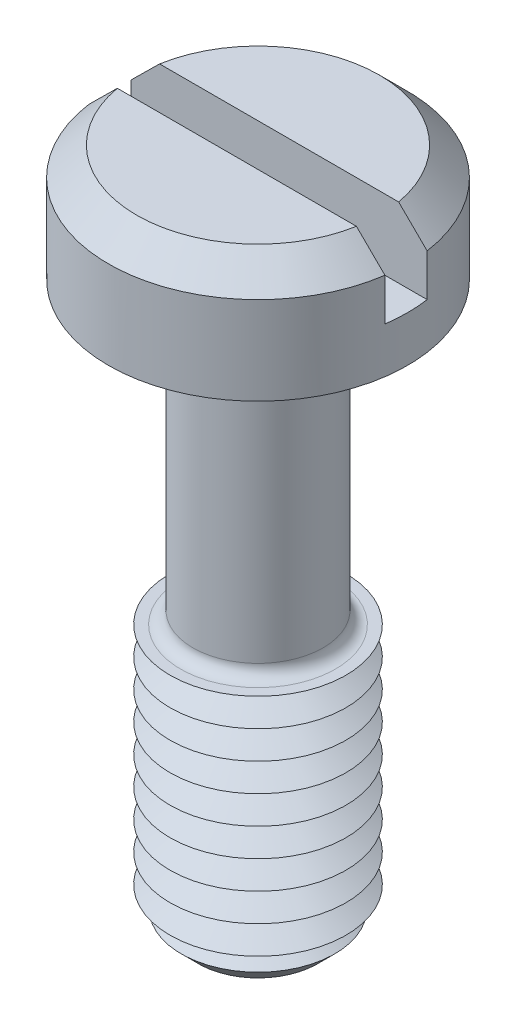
from build123d import *

# Parameters (mm, degrees)
SKETCH1_R           = 4.25
BOSS_EXTRUDE1_DEPTH = 3.3
SKETCH2_R           = 1.85
BOSS_EXTRUDE2_DEPTH = 16
SKETCH3_R           = 2.5
BOSS_EXTRUDE3_DEPTH = 7.5
CHAMFER1_SIZE       = 0.8
LPATTERN1_COUNT     = 9
LPATTERN1_PITCH     = 0.8
FILLET1_R           = 0.35
CHAMFER2_SIZE       = 0.8
SKETCH6_W           = 8.5
SKETCH6_H           = 1.2
CUT_EXTRUDE1_DEPTH  = 2


with BuildPart() as part:
    # Sketch1 → Boss-Extrude1 (new body)
    with BuildSketch(Plane(origin=(0, 0, 0), x_dir=(1, 0, 0), z_dir=(0, 1, 0))):
        with Locations(Location((0, 0, 0), (0, 0, 270))):
            Circle(SKETCH1_R)
    extrude(amount=BOSS_EXTRUDE1_DEPTH)

    # Sketch2 → Boss-Extrude2 (add)
    with BuildSketch(Plane.XZ):
        with Locations(Location((0, 0, 0), (0, 0, 270))):
            Circle(SKETCH2_R)
    extrude(amount=BOSS_EXTRUDE2_DEPTH)

    # Sketch3 → Boss-Extrude3 (add)
    with BuildSketch(Plane.XZ.offset(16)):
        with Locations(Location((0, 0, 0), (0, 0, 270))):
            Circle(SKETCH3_R)
    extrude(amount=-BOSS_EXTRUDE3_DEPTH)

    # Chamfer1
    chamfer1_edges = [part.edges().sort_by_distance(p)[0] for p in [
        (0, -16, 2.5),
    ]]
    chamfer(chamfer1_edges, length=CHAMFER1_SIZE)

    # Sketch5 → Cut-Revolve1 (revolve, cut)
    with BuildSketch(Plane(origin=(0, 0, 0), x_dir=(0, 0, -1), z_dir=(1, 0, 0))):
        Polygon((-2.5, -8.5), (-1.807179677, -8.9), (-2.5, -9.3), align=None)
    cut_revolve1 = revolve(axis=Axis((0, -6.58711856, 0), (0, -1, 0)), mode=Mode.SUBTRACT)

    # LPattern1: Cut-Revolve1 ×9
    with Locations(*[(0, -i * LPATTERN1_PITCH, 0) for i in range(1, LPATTERN1_COUNT)]):
        add(cut_revolve1, mode=Mode.SUBTRACT)

    # Fillet1
    fillet1_edges = [part.edges().sort_by_distance(p)[0] for p in [
        (0, 0, 1.85),
        (0, -8.5, 1.85),
    ]]
    fillet(fillet1_edges, radius=FILLET1_R)

    # Chamfer2
    chamfer2_edges = [part.edges().sort_by_distance(p)[0] for p in [
        (0, 3.3, -4.25),
    ]]
    chamfer(chamfer2_edges, length=CHAMFER2_SIZE)

    # Sketch6 → Cut-Extrude1 (cut)
    with BuildSketch(Plane(origin=(0, 3.3, 0), x_dir=(1, 0, 0), z_dir=(0, 1, 0))):
        Rectangle(SKETCH6_W, SKETCH6_H)
    extrude(amount=-CUT_EXTRUDE1_DEPTH, mode=Mode.SUBTRACT)


solid = part.part
